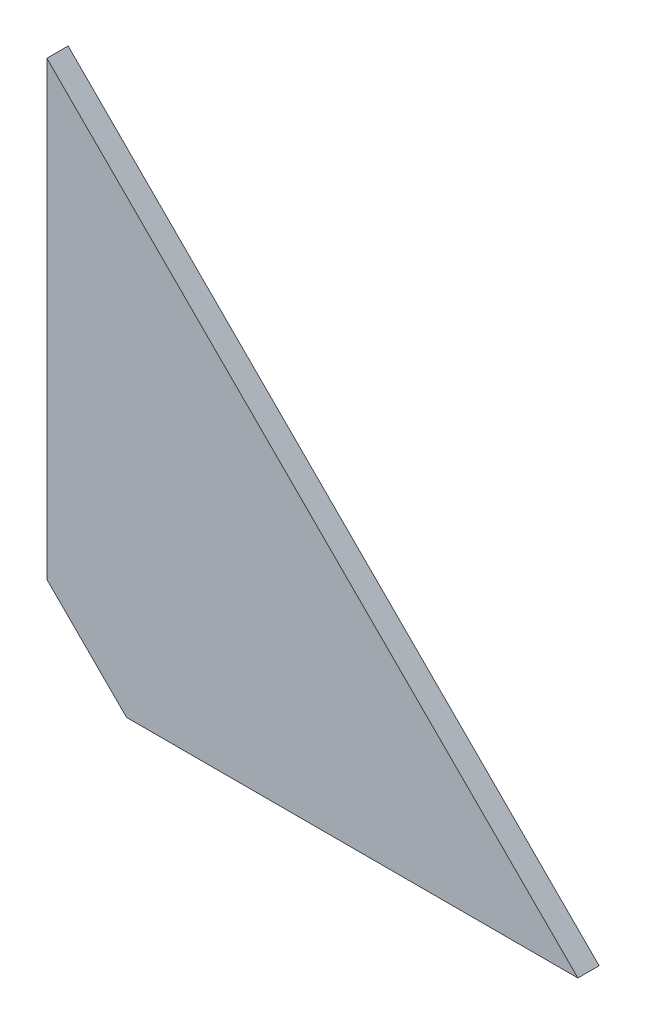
ISO-10303-21;
HEADER;
FILE_DESCRIPTION(('STEP AP214'),'2;1');
FILE_NAME('part.step','',(''),(''),'','','');
FILE_SCHEMA(('AUTOMOTIVE_DESIGN { 1 0 10303 214 1 1 1 1 }'));
ENDSEC;
DATA;
#1=APPLICATION_CONTEXT('core data for automotive mechanical design processes');
#2=APPLICATION_PROTOCOL_DEFINITION('international standard','automotive_design',2000,#1);
#3=PRODUCT_CONTEXT('',#1,'mechanical');
#4=PRODUCT('Part','Part','',(#3));
#5=PRODUCT_RELATED_PRODUCT_CATEGORY('part','',(#4));
#6=PRODUCT_DEFINITION_FORMATION('','',#4);
#7=PRODUCT_DEFINITION_CONTEXT('part definition',#1,'design');
#8=PRODUCT_DEFINITION('design','',#6,#7);
#9=PRODUCT_DEFINITION_SHAPE('','',#8);
#10=(LENGTH_UNIT() NAMED_UNIT(*) SI_UNIT(.MILLI.,.METRE.));
#11=(NAMED_UNIT(*) PLANE_ANGLE_UNIT() SI_UNIT($,.RADIAN.));
#12=(NAMED_UNIT(*) SI_UNIT($,.STERADIAN.) SOLID_ANGLE_UNIT());
#13=UNCERTAINTY_MEASURE_WITH_UNIT(LENGTH_MEASURE(1.E-05),#10,'distance_accuracy_value','');
#14=(GEOMETRIC_REPRESENTATION_CONTEXT(3) GLOBAL_UNCERTAINTY_ASSIGNED_CONTEXT((#13)) GLOBAL_UNIT_ASSIGNED_CONTEXT((#10,
#11,#12)) REPRESENTATION_CONTEXT('',''));
#15=CARTESIAN_POINT('',(0.,0.,0.));
#16=DIRECTION('',(0.,0.,1.));
#17=DIRECTION('',(1.,0.,0.));
#18=AXIS2_PLACEMENT_3D('',#15,#16,#17);
#19=CARTESIAN_POINT('',(0.,29.9999999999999,8.));
#20=DIRECTION('',(1.,0.,0.));
#21=DIRECTION('',(0.,0.,-1.));
#22=AXIS2_PLACEMENT_3D('',#19,#20,#21);
#23=PLANE('',#22);
#24=DIRECTION('',(0.,-1.,0.));
#25=VECTOR('',#24,1.);
#26=CARTESIAN_POINT('',(0.,29.9999999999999,0.));
#27=LINE('',#26,#25);
#28=CARTESIAN_POINT('',(0.,200.,0.));
#29=VERTEX_POINT('',#28);
#30=CARTESIAN_POINT('',(0.,29.9999999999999,0.));
#31=VERTEX_POINT('',#30);
#32=EDGE_CURVE('E68',#29,#31,#27,.T.);
#33=ORIENTED_EDGE('',*,*,#32,.T.);
#34=DIRECTION('',(0.,0.,-1.));
#35=VECTOR('',#34,1.);
#36=CARTESIAN_POINT('',(0.,29.9999999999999,8.));
#37=LINE('',#36,#35);
#38=CARTESIAN_POINT('',(0.,29.9999999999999,8.));
#39=VERTEX_POINT('',#38);
#40=EDGE_CURVE('E11',#39,#31,#37,.T.);
#41=ORIENTED_EDGE('',*,*,#40,.F.);
#42=DIRECTION('',(0.,-1.,0.));
#43=VECTOR('',#42,1.);
#44=CARTESIAN_POINT('',(0.,29.9999999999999,8.));
#45=LINE('',#44,#43);
#46=CARTESIAN_POINT('',(0.,200.,8.));
#47=VERTEX_POINT('',#46);
#48=EDGE_CURVE('E86',#47,#39,#45,.T.);
#49=ORIENTED_EDGE('',*,*,#48,.F.);
#50=DIRECTION('',(0.,0.,-1.));
#51=VECTOR('',#50,1.);
#52=CARTESIAN_POINT('',(0.,200.,8.));
#53=LINE('',#52,#51);
#54=EDGE_CURVE('E80',#47,#29,#53,.T.);
#55=ORIENTED_EDGE('',*,*,#54,.T.);
#56=EDGE_LOOP('',(#33,#41,#49,#55));
#57=FACE_BOUND('',#56,.T.);
#58=ADVANCED_FACE('F24',(#57),#23,.F.);
#59=CARTESIAN_POINT('',(29.9999999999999,0.,8.));
#60=DIRECTION('',(0.707106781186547,0.707106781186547,0.));
#61=DIRECTION('',(-0.707106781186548,0.707106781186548,0.));
#62=AXIS2_PLACEMENT_3D('',#59,#60,#61);
#63=PLANE('',#62);
#64=DIRECTION('',(0.707106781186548,-0.707106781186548,0.));
#65=VECTOR('',#64,1.);
#66=CARTESIAN_POINT('',(29.9999999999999,0.,0.));
#67=LINE('',#66,#65);
#68=CARTESIAN_POINT('',(29.9999999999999,0.,0.));
#69=VERTEX_POINT('',#68);
#70=EDGE_CURVE('E64',#31,#69,#67,.T.);
#71=ORIENTED_EDGE('',*,*,#70,.T.);
#72=DIRECTION('',(0.,0.,-1.));
#73=VECTOR('',#72,1.);
#74=CARTESIAN_POINT('',(29.9999999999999,0.,8.));
#75=LINE('',#74,#73);
#76=CARTESIAN_POINT('',(29.9999999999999,0.,8.));
#77=VERTEX_POINT('',#76);
#78=EDGE_CURVE('E31',#77,#69,#75,.T.);
#79=ORIENTED_EDGE('',*,*,#78,.F.);
#80=DIRECTION('',(0.707106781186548,-0.707106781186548,0.));
#81=VECTOR('',#80,1.);
#82=CARTESIAN_POINT('',(29.9999999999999,0.,8.));
#83=LINE('',#82,#81);
#84=EDGE_CURVE('E76',#39,#77,#83,.T.);
#85=ORIENTED_EDGE('',*,*,#84,.F.);
#86=ORIENTED_EDGE('',*,*,#40,.T.);
#87=EDGE_LOOP('',(#71,#79,#85,#86));
#88=FACE_BOUND('',#87,.T.);
#89=ADVANCED_FACE('F75',(#88),#63,.F.);
#90=CARTESIAN_POINT('',(29.9999999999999,0.,8.));
#91=DIRECTION('',(0.,1.,0.));
#92=DIRECTION('',(0.,0.,1.));
#93=AXIS2_PLACEMENT_3D('',#90,#91,#92);
#94=PLANE('',#93);
#95=DIRECTION('',(1.,0.,0.));
#96=VECTOR('',#95,1.);
#97=CARTESIAN_POINT('',(29.9999999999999,0.,0.));
#98=LINE('',#97,#96);
#99=CARTESIAN_POINT('',(200.,0.,0.));
#100=VERTEX_POINT('',#99);
#101=EDGE_CURVE('E69',#69,#100,#98,.T.);
#102=ORIENTED_EDGE('',*,*,#101,.T.);
#103=DIRECTION('',(0.,0.,-1.));
#104=VECTOR('',#103,1.);
#105=CARTESIAN_POINT('',(200.,0.,8.));
#106=LINE('',#105,#104);
#107=CARTESIAN_POINT('',(200.,0.,8.));
#108=VERTEX_POINT('',#107);
#109=EDGE_CURVE('E92',#108,#100,#106,.T.);
#110=ORIENTED_EDGE('',*,*,#109,.F.);
#111=DIRECTION('',(1.,0.,0.));
#112=VECTOR('',#111,1.);
#113=CARTESIAN_POINT('',(29.9999999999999,0.,8.));
#114=LINE('',#113,#112);
#115=EDGE_CURVE('E43',#77,#108,#114,.T.);
#116=ORIENTED_EDGE('',*,*,#115,.F.);
#117=ORIENTED_EDGE('',*,*,#78,.T.);
#118=EDGE_LOOP('',(#102,#110,#116,#117));
#119=FACE_BOUND('',#118,.T.);
#120=ADVANCED_FACE('F95',(#119),#94,.F.);
#121=CARTESIAN_POINT('',(0.,200.,8.));
#122=DIRECTION('',(-0.707106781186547,-0.707106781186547,0.));
#123=DIRECTION('',(0.707106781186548,-0.707106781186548,0.));
#124=AXIS2_PLACEMENT_3D('',#121,#122,#123);
#125=PLANE('',#124);
#126=DIRECTION('',(-0.707106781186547,0.707106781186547,0.));
#127=VECTOR('',#126,1.);
#128=CARTESIAN_POINT('',(0.,200.,0.));
#129=LINE('',#128,#127);
#130=EDGE_CURVE('E84',#100,#29,#129,.T.);
#131=ORIENTED_EDGE('',*,*,#130,.T.);
#132=ORIENTED_EDGE('',*,*,#54,.F.);
#133=DIRECTION('',(-0.707106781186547,0.707106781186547,0.));
#134=VECTOR('',#133,1.);
#135=CARTESIAN_POINT('',(0.,200.,8.));
#136=LINE('',#135,#134);
#137=EDGE_CURVE('E38',#108,#47,#136,.T.);
#138=ORIENTED_EDGE('',*,*,#137,.F.);
#139=ORIENTED_EDGE('',*,*,#109,.T.);
#140=EDGE_LOOP('',(#131,#132,#138,#139));
#141=FACE_BOUND('',#140,.T.);
#142=ADVANCED_FACE('F97',(#141),#125,.F.);
#143=CARTESIAN_POINT('',(0.,0.,8.));
#144=DIRECTION('',(0.,0.,-1.));
#145=DIRECTION('',(-1.,0.,0.));
#146=AXIS2_PLACEMENT_3D('',#143,#144,#145);
#147=PLANE('',#146);
#148=ORIENTED_EDGE('',*,*,#48,.T.);
#149=ORIENTED_EDGE('',*,*,#84,.T.);
#150=ORIENTED_EDGE('',*,*,#115,.T.);
#151=ORIENTED_EDGE('',*,*,#137,.T.);
#152=EDGE_LOOP('',(#148,#149,#150,#151));
#153=FACE_BOUND('',#152,.T.);
#154=ADVANCED_FACE('F98',(#153),#147,.F.);
#155=CARTESIAN_POINT('',(0.,0.,0.));
#156=DIRECTION('',(0.,0.,-1.));
#157=DIRECTION('',(-1.,0.,0.));
#158=AXIS2_PLACEMENT_3D('',#155,#156,#157);
#159=PLANE('',#158);
#160=ORIENTED_EDGE('',*,*,#32,.F.);
#161=ORIENTED_EDGE('',*,*,#130,.F.);
#162=ORIENTED_EDGE('',*,*,#101,.F.);
#163=ORIENTED_EDGE('',*,*,#70,.F.);
#164=EDGE_LOOP('',(#160,#161,#162,#163));
#165=FACE_BOUND('',#164,.T.);
#166=ADVANCED_FACE('F65',(#165),#159,.T.);
#167=CLOSED_SHELL('',(#58,#89,#120,#142,#154,#166));
#168=MANIFOLD_SOLID_BREP('B2',#167);
#169=ADVANCED_BREP_SHAPE_REPRESENTATION('',(#18,#168),#14);
#170=SHAPE_DEFINITION_REPRESENTATION(#9,#169);
ENDSEC;
END-ISO-10303-21;
